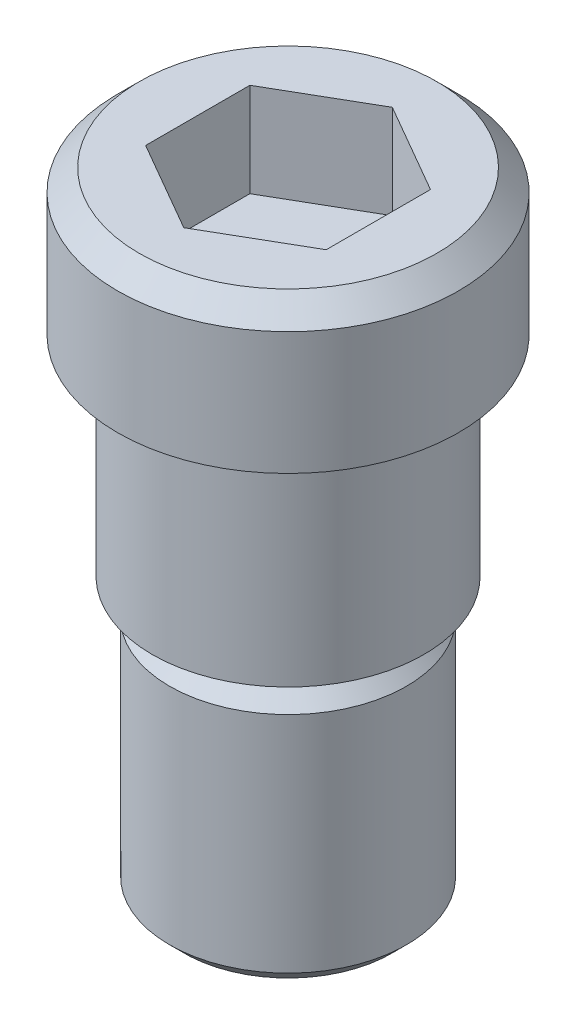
ISO-10303-21;
HEADER;
FILE_DESCRIPTION(('STEP AP214'),'2;1');
FILE_NAME('part.step','',(''),(''),'','','');
FILE_SCHEMA(('AUTOMOTIVE_DESIGN { 1 0 10303 214 1 1 1 1 }'));
ENDSEC;
DATA;
#1=APPLICATION_CONTEXT('core data for automotive mechanical design processes');
#2=APPLICATION_PROTOCOL_DEFINITION('international standard','automotive_design',2000,#1);
#3=PRODUCT_CONTEXT('',#1,'mechanical');
#4=PRODUCT('Part','Part','',(#3));
#5=PRODUCT_RELATED_PRODUCT_CATEGORY('part','',(#4));
#6=PRODUCT_DEFINITION_FORMATION('','',#4);
#7=PRODUCT_DEFINITION_CONTEXT('part definition',#1,'design');
#8=PRODUCT_DEFINITION('design','',#6,#7);
#9=PRODUCT_DEFINITION_SHAPE('','',#8);
#10=(LENGTH_UNIT() NAMED_UNIT(*) SI_UNIT(.MILLI.,.METRE.));
#11=(NAMED_UNIT(*) PLANE_ANGLE_UNIT() SI_UNIT($,.RADIAN.));
#12=(NAMED_UNIT(*) SI_UNIT($,.STERADIAN.) SOLID_ANGLE_UNIT());
#13=UNCERTAINTY_MEASURE_WITH_UNIT(LENGTH_MEASURE(1.E-05),#10,'distance_accuracy_value','');
#14=(GEOMETRIC_REPRESENTATION_CONTEXT(3) GLOBAL_UNCERTAINTY_ASSIGNED_CONTEXT((#13)) GLOBAL_UNIT_ASSIGNED_CONTEXT((#10,
#11,#12)) REPRESENTATION_CONTEXT('',''));
#15=CARTESIAN_POINT('',(0.,0.,0.));
#16=DIRECTION('',(0.,0.,1.));
#17=DIRECTION('',(1.,0.,0.));
#18=AXIS2_PLACEMENT_3D('',#15,#16,#17);
#19=CARTESIAN_POINT('',(-2.0828,-8.509,0.));
#20=DIRECTION('',(0.,-1.,0.));
#21=DIRECTION('',(0.,0.,-1.));
#22=AXIS2_PLACEMENT_3D('',#19,#20,#21);
#23=PLANE('',#22);
#24=CARTESIAN_POINT('',(0.,-8.509,0.));
#25=DIRECTION('',(0.,-1.,0.));
#26=DIRECTION('',(0.,0.,-1.));
#27=AXIS2_PLACEMENT_3D('',#24,#25,#26);
#28=CIRCLE('',#27,1.8288);
#29=CARTESIAN_POINT('',(0.,-8.509,-1.8288));
#30=VERTEX_POINT('',#29);
#31=EDGE_CURVE('E169',#30,#30,#28,.T.);
#32=ORIENTED_EDGE('',*,*,#31,.T.);
#33=EDGE_LOOP('',(#32));
#34=FACE_BOUND('',#33,.T.);
#35=ADVANCED_FACE('F32',(#34),#23,.T.);
#36=CARTESIAN_POINT('',(0.,7.87793789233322,0.));
#37=DIRECTION('',(0.,1.,0.));
#38=DIRECTION('',(0.,0.,1.));
#39=AXIS2_PLACEMENT_3D('',#36,#37,#38);
#40=CYLINDRICAL_SURFACE('',#39,2.0828);
#41=CARTESIAN_POINT('',(0.,-4.318,0.));
#42=DIRECTION('',(0.,1.,0.));
#43=DIRECTION('',(0.,0.,1.));
#44=AXIS2_PLACEMENT_3D('',#41,#42,#43);
#45=CIRCLE('',#44,2.0828);
#46=CARTESIAN_POINT('',(0.,-4.318,2.0828));
#47=VERTEX_POINT('',#46);
#48=EDGE_CURVE('E11',#47,#47,#45,.F.);
#49=ORIENTED_EDGE('',*,*,#48,.T.);
#50=EDGE_LOOP('',(#49));
#51=FACE_BOUND('',#50,.T.);
#52=CARTESIAN_POINT('',(0.,-8.255,0.));
#53=DIRECTION('',(0.,-1.,0.));
#54=DIRECTION('',(0.,0.,-1.));
#55=AXIS2_PLACEMENT_3D('',#52,#53,#54);
#56=CIRCLE('',#55,2.0828);
#57=CARTESIAN_POINT('',(0.,-8.255,-2.0828));
#58=VERTEX_POINT('',#57);
#59=EDGE_CURVE('E166',#58,#58,#56,.F.);
#60=ORIENTED_EDGE('',*,*,#59,.T.);
#61=EDGE_LOOP('',(#60));
#62=FACE_BOUND('',#61,.T.);
#63=ADVANCED_FACE('F186',(#51,#62),#40,.T.);
#64=CARTESIAN_POINT('',(-2.0828,-4.064,0.));
#65=DIRECTION('',(0.,1.,0.));
#66=DIRECTION('',(0.,0.,1.));
#67=AXIS2_PLACEMENT_3D('',#64,#65,#66);
#68=PLANE('',#67);
#69=CARTESIAN_POINT('',(0.,-4.064,0.));
#70=DIRECTION('',(0.,1.,0.));
#71=DIRECTION('',(0.,0.,1.));
#72=AXIS2_PLACEMENT_3D('',#69,#70,#71);
#73=CIRCLE('',#72,1.8288);
#74=CARTESIAN_POINT('',(0.,-4.064,1.8288));
#75=VERTEX_POINT('',#74);
#76=EDGE_CURVE('E40',#75,#75,#73,.T.);
#77=ORIENTED_EDGE('',*,*,#76,.T.);
#78=EDGE_LOOP('',(#77));
#79=FACE_BOUND('',#78,.T.);
#80=CARTESIAN_POINT('',(0.,-4.064,0.));
#81=DIRECTION('',(0.,1.,0.));
#82=DIRECTION('',(0.,0.,1.));
#83=AXIS2_PLACEMENT_3D('',#80,#81,#82);
#84=CIRCLE('',#83,1.685925);
#85=CARTESIAN_POINT('',(0.,-4.064,1.685925));
#86=VERTEX_POINT('',#85);
#87=EDGE_CURVE('E157',#86,#86,#84,.T.);
#88=ORIENTED_EDGE('',*,*,#87,.F.);
#89=EDGE_LOOP('',(#88));
#90=FACE_BOUND('',#89,.T.);
#91=ADVANCED_FACE('F174',(#79,#90),#68,.T.);
#92=CARTESIAN_POINT('',(0.,7.87793789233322,0.));
#93=DIRECTION('',(0.,1.,0.));
#94=DIRECTION('',(0.,0.,1.));
#95=AXIS2_PLACEMENT_3D('',#92,#93,#94);
#96=CYLINDRICAL_SURFACE('',#95,1.685925);
#97=ORIENTED_EDGE('',*,*,#87,.T.);
#98=EDGE_LOOP('',(#97));
#99=FACE_BOUND('',#98,.T.);
#100=CARTESIAN_POINT('',(0.,-3.683,0.));
#101=DIRECTION('',(0.,1.,0.));
#102=DIRECTION('',(0.,0.,1.));
#103=AXIS2_PLACEMENT_3D('',#100,#101,#102);
#104=CIRCLE('',#103,1.685925);
#105=CARTESIAN_POINT('',(0.,-3.683,1.685925));
#106=VERTEX_POINT('',#105);
#107=EDGE_CURVE('E154',#106,#106,#104,.T.);
#108=ORIENTED_EDGE('',*,*,#107,.F.);
#109=EDGE_LOOP('',(#108));
#110=FACE_BOUND('',#109,.T.);
#111=ADVANCED_FACE('F246',(#99,#110),#96,.T.);
#112=CARTESIAN_POINT('',(-2.3876,-3.683,0.));
#113=DIRECTION('',(0.,-1.,0.));
#114=DIRECTION('',(0.,0.,-1.));
#115=AXIS2_PLACEMENT_3D('',#112,#113,#114);
#116=PLANE('',#115);
#117=ORIENTED_EDGE('',*,*,#107,.T.);
#118=EDGE_LOOP('',(#117));
#119=FACE_BOUND('',#118,.T.);
#120=CARTESIAN_POINT('',(0.,-3.683,0.));
#121=DIRECTION('',(0.,1.,0.));
#122=DIRECTION('',(0.,0.,1.));
#123=AXIS2_PLACEMENT_3D('',#120,#121,#122);
#124=CIRCLE('',#123,2.3876);
#125=CARTESIAN_POINT('',(0.,-3.683,2.3876));
#126=VERTEX_POINT('',#125);
#127=EDGE_CURVE('E151',#126,#126,#124,.T.);
#128=ORIENTED_EDGE('',*,*,#127,.F.);
#129=EDGE_LOOP('',(#128));
#130=FACE_BOUND('',#129,.T.);
#131=ADVANCED_FACE('F242',(#119,#130),#116,.T.);
#132=CARTESIAN_POINT('',(0.,7.87793789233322,0.));
#133=DIRECTION('',(0.,1.,0.));
#134=DIRECTION('',(0.,0.,1.));
#135=AXIS2_PLACEMENT_3D('',#132,#133,#134);
#136=CYLINDRICAL_SURFACE('',#135,2.3876);
#137=ORIENTED_EDGE('',*,*,#127,.T.);
#138=EDGE_LOOP('',(#137));
#139=FACE_BOUND('',#138,.T.);
#140=CARTESIAN_POINT('',(0.,-0.380999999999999,0.));
#141=DIRECTION('',(0.,1.,0.));
#142=DIRECTION('',(0.,0.,1.));
#143=AXIS2_PLACEMENT_3D('',#140,#141,#142);
#144=CIRCLE('',#143,2.3876);
#145=CARTESIAN_POINT('',(0.,-0.380999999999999,2.3876));
#146=VERTEX_POINT('',#145);
#147=EDGE_CURVE('E148',#146,#146,#144,.T.);
#148=ORIENTED_EDGE('',*,*,#147,.F.);
#149=EDGE_LOOP('',(#148));
#150=FACE_BOUND('',#149,.T.);
#151=ADVANCED_FACE('F238',(#139,#150),#136,.T.);
#152=CARTESIAN_POINT('',(-2.3876,-0.381,0.));
#153=DIRECTION('',(0.,1.,0.));
#154=DIRECTION('',(0.,0.,1.));
#155=AXIS2_PLACEMENT_3D('',#152,#153,#154);
#156=PLANE('',#155);
#157=ORIENTED_EDGE('',*,*,#147,.T.);
#158=EDGE_LOOP('',(#157));
#159=FACE_BOUND('',#158,.T.);
#160=CARTESIAN_POINT('',(0.,-0.380999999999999,0.));
#161=DIRECTION('',(0.,1.,0.));
#162=DIRECTION('',(0.,0.,1.));
#163=AXIS2_PLACEMENT_3D('',#160,#161,#162);
#164=CIRCLE('',#163,1.990725);
#165=CARTESIAN_POINT('',(0.,-0.380999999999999,1.990725));
#166=VERTEX_POINT('',#165);
#167=EDGE_CURVE('E145',#166,#166,#164,.T.);
#168=ORIENTED_EDGE('',*,*,#167,.F.);
#169=EDGE_LOOP('',(#168));
#170=FACE_BOUND('',#169,.T.);
#171=ADVANCED_FACE('F234',(#159,#170),#156,.T.);
#172=CARTESIAN_POINT('',(0.,7.87793789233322,0.));
#173=DIRECTION('',(0.,1.,0.));
#174=DIRECTION('',(0.,0.,1.));
#175=AXIS2_PLACEMENT_3D('',#172,#173,#174);
#176=CYLINDRICAL_SURFACE('',#175,1.990725);
#177=ORIENTED_EDGE('',*,*,#167,.T.);
#178=EDGE_LOOP('',(#177));
#179=FACE_BOUND('',#178,.T.);
#180=CARTESIAN_POINT('',(0.,0.,0.));
#181=DIRECTION('',(0.,1.,0.));
#182=DIRECTION('',(0.,0.,1.));
#183=AXIS2_PLACEMENT_3D('',#180,#181,#182);
#184=CIRCLE('',#183,1.990725);
#185=CARTESIAN_POINT('',(0.,0.,1.990725));
#186=VERTEX_POINT('',#185);
#187=EDGE_CURVE('E142',#186,#186,#184,.T.);
#188=ORIENTED_EDGE('',*,*,#187,.F.);
#189=EDGE_LOOP('',(#188));
#190=FACE_BOUND('',#189,.T.);
#191=ADVANCED_FACE('F230',(#179,#190),#176,.T.);
#192=CARTESIAN_POINT('',(-2.9972,0.,0.));
#193=DIRECTION('',(0.,-1.,0.));
#194=DIRECTION('',(0.,0.,-1.));
#195=AXIS2_PLACEMENT_3D('',#192,#193,#194);
#196=PLANE('',#195);
#197=ORIENTED_EDGE('',*,*,#187,.T.);
#198=EDGE_LOOP('',(#197));
#199=FACE_BOUND('',#198,.T.);
#200=CARTESIAN_POINT('',(0.,0.,0.));
#201=DIRECTION('',(0.,1.,0.));
#202=DIRECTION('',(0.,0.,1.));
#203=AXIS2_PLACEMENT_3D('',#200,#201,#202);
#204=CIRCLE('',#203,2.9972);
#205=CARTESIAN_POINT('',(0.,0.,2.9972));
#206=VERTEX_POINT('',#205);
#207=EDGE_CURVE('E134',#206,#206,#204,.T.);
#208=ORIENTED_EDGE('',*,*,#207,.F.);
#209=EDGE_LOOP('',(#208));
#210=FACE_BOUND('',#209,.T.);
#211=ADVANCED_FACE('F226',(#199,#210),#196,.T.);
#212=CARTESIAN_POINT('',(0.,7.87793789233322,0.));
#213=DIRECTION('',(0.,1.,0.));
#214=DIRECTION('',(0.,0.,1.));
#215=AXIS2_PLACEMENT_3D('',#212,#213,#214);
#216=CYLINDRICAL_SURFACE('',#215,2.9972);
#217=CARTESIAN_POINT('',(0.,2.159,0.));
#218=DIRECTION('',(0.,1.,0.));
#219=DIRECTION('',(0.,0.,1.));
#220=AXIS2_PLACEMENT_3D('',#217,#218,#219);
#221=CIRCLE('',#220,2.9972);
#222=CARTESIAN_POINT('',(0.,2.159,2.9972));
#223=VERTEX_POINT('',#222);
#224=EDGE_CURVE('E163',#223,#223,#221,.F.);
#225=ORIENTED_EDGE('',*,*,#224,.T.);
#226=EDGE_LOOP('',(#225));
#227=FACE_BOUND('',#226,.T.);
#228=ORIENTED_EDGE('',*,*,#207,.T.);
#229=EDGE_LOOP('',(#228));
#230=FACE_BOUND('',#229,.T.);
#231=ADVANCED_FACE('F222',(#227,#230),#216,.T.);
#232=CARTESIAN_POINT('',(0.,2.54,0.));
#233=DIRECTION('',(0.,1.,0.));
#234=DIRECTION('',(0.,0.,1.));
#235=AXIS2_PLACEMENT_3D('',#232,#233,#234);
#236=PLANE('',#235);
#237=DIRECTION('',(-0.866025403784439,0.,0.499999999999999));
#238=VECTOR('',#237,1.);
#239=CARTESIAN_POINT('',(-1.5875,2.54,-0.916543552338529));
#240=LINE('',#239,#238);
#241=CARTESIAN_POINT('',(0.,2.54,-1.83308710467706));
#242=VERTEX_POINT('',#241);
#243=CARTESIAN_POINT('',(-1.5875,2.54,-0.916543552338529));
#244=VERTEX_POINT('',#243);
#245=EDGE_CURVE('E47',#242,#244,#240,.T.);
#246=ORIENTED_EDGE('',*,*,#245,.F.);
#247=DIRECTION('',(-0.866025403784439,0.,-0.499999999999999));
#248=VECTOR('',#247,1.);
#249=CARTESIAN_POINT('',(0.,2.54,-1.83308710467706));
#250=LINE('',#249,#248);
#251=CARTESIAN_POINT('',(1.5875,2.54,-0.916543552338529));
#252=VERTEX_POINT('',#251);
#253=EDGE_CURVE('E130',#252,#242,#250,.T.);
#254=ORIENTED_EDGE('',*,*,#253,.F.);
#255=DIRECTION('',(0.,0.,-1.));
#256=VECTOR('',#255,1.);
#257=CARTESIAN_POINT('',(1.5875,2.54,-0.916543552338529));
#258=LINE('',#257,#256);
#259=CARTESIAN_POINT('',(1.5875,2.54,0.916543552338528));
#260=VERTEX_POINT('',#259);
#261=EDGE_CURVE('E128',#260,#252,#258,.T.);
#262=ORIENTED_EDGE('',*,*,#261,.F.);
#263=DIRECTION('',(0.866025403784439,0.,-0.499999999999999));
#264=VECTOR('',#263,1.);
#265=CARTESIAN_POINT('',(0.,2.54,1.83308710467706));
#266=LINE('',#265,#264);
#267=CARTESIAN_POINT('',(0.,2.54,1.83308710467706));
#268=VERTEX_POINT('',#267);
#269=EDGE_CURVE('E95',#268,#260,#266,.T.);
#270=ORIENTED_EDGE('',*,*,#269,.F.);
#271=DIRECTION('',(0.86602540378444,0.,0.499999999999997));
#272=VECTOR('',#271,1.);
#273=CARTESIAN_POINT('',(-1.5875,2.54,0.916543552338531));
#274=LINE('',#273,#272);
#275=CARTESIAN_POINT('',(-1.5875,2.54,0.916543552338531));
#276=VERTEX_POINT('',#275);
#277=EDGE_CURVE('E124',#276,#268,#274,.T.);
#278=ORIENTED_EDGE('',*,*,#277,.F.);
#279=DIRECTION('',(0.,0.,1.));
#280=VECTOR('',#279,1.);
#281=CARTESIAN_POINT('',(-1.5875,2.54,0.916543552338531));
#282=LINE('',#281,#280);
#283=EDGE_CURVE('E121',#244,#276,#282,.T.);
#284=ORIENTED_EDGE('',*,*,#283,.F.);
#285=EDGE_LOOP('',(#246,#254,#262,#270,#278,#284));
#286=FACE_BOUND('',#285,.T.);
#287=CARTESIAN_POINT('',(0.,2.54,0.));
#288=DIRECTION('',(0.,1.,0.));
#289=DIRECTION('',(0.,0.,1.));
#290=AXIS2_PLACEMENT_3D('',#287,#288,#289);
#291=CIRCLE('',#290,2.6162);
#292=CARTESIAN_POINT('',(0.,2.54,2.6162));
#293=VERTEX_POINT('',#292);
#294=EDGE_CURVE('E160',#293,#293,#291,.T.);
#295=ORIENTED_EDGE('',*,*,#294,.T.);
#296=EDGE_LOOP('',(#295));
#297=FACE_BOUND('',#296,.T.);
#298=ADVANCED_FACE('F199',(#286,#297),#236,.T.);
#299=CARTESIAN_POINT('',(0.,2.54,0.));
#300=DIRECTION('',(0.,-1.,0.));
#301=DIRECTION('',(0.,0.,-1.));
#302=AXIS2_PLACEMENT_3D('',#299,#300,#301);
#303=CONICAL_SURFACE('',#302,2.6162,0.785398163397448);
#304=ORIENTED_EDGE('',*,*,#224,.F.);
#305=EDGE_LOOP('',(#304));
#306=FACE_BOUND('',#305,.T.);
#307=ORIENTED_EDGE('',*,*,#294,.F.);
#308=EDGE_LOOP('',(#307));
#309=FACE_BOUND('',#308,.T.);
#310=ADVANCED_FACE('F196',(#306,#309),#303,.T.);
#311=CARTESIAN_POINT('',(0.,-8.255,0.));
#312=DIRECTION('',(0.,1.,0.));
#313=DIRECTION('',(0.,0.,1.));
#314=AXIS2_PLACEMENT_3D('',#311,#312,#313);
#315=CONICAL_SURFACE('',#314,2.0828,0.78539816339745);
#316=ORIENTED_EDGE('',*,*,#31,.F.);
#317=EDGE_LOOP('',(#316));
#318=FACE_BOUND('',#317,.T.);
#319=ORIENTED_EDGE('',*,*,#59,.F.);
#320=EDGE_LOOP('',(#319));
#321=FACE_BOUND('',#320,.T.);
#322=ADVANCED_FACE('F198',(#318,#321),#315,.T.);
#323=CARTESIAN_POINT('',(-1.5875,0.889000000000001,-0.916543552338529));
#324=DIRECTION('',(-0.499999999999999,0.,-0.866025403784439));
#325=DIRECTION('',(-0.86602540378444,0.,0.499999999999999));
#326=AXIS2_PLACEMENT_3D('',#323,#324,#325);
#327=PLANE('',#326);
#328=ORIENTED_EDGE('',*,*,#245,.T.);
#329=DIRECTION('',(0.,1.,0.));
#330=VECTOR('',#329,1.);
#331=CARTESIAN_POINT('',(-1.5875,0.889000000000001,-0.916543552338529));
#332=LINE('',#331,#330);
#333=CARTESIAN_POINT('',(-1.5875,0.889000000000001,-0.916543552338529));
#334=VERTEX_POINT('',#333);
#335=EDGE_CURVE('E77',#334,#244,#332,.T.);
#336=ORIENTED_EDGE('',*,*,#335,.F.);
#337=DIRECTION('',(-0.866025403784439,0.,0.499999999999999));
#338=VECTOR('',#337,1.);
#339=CARTESIAN_POINT('',(-1.5875,0.889000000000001,-0.916543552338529));
#340=LINE('',#339,#338);
#341=CARTESIAN_POINT('',(0.,0.889000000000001,-1.83308710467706));
#342=VERTEX_POINT('',#341);
#343=EDGE_CURVE('E132',#342,#334,#340,.T.);
#344=ORIENTED_EDGE('',*,*,#343,.F.);
#345=DIRECTION('',(0.,1.,0.));
#346=VECTOR('',#345,1.);
#347=CARTESIAN_POINT('',(0.,0.889000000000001,-1.83308710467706));
#348=LINE('',#347,#346);
#349=EDGE_CURVE('E55',#342,#242,#348,.T.);
#350=ORIENTED_EDGE('',*,*,#349,.T.);
#351=EDGE_LOOP('',(#328,#336,#344,#350));
#352=FACE_BOUND('',#351,.T.);
#353=ADVANCED_FACE('F202',(#352),#327,.F.);
#354=CARTESIAN_POINT('',(0.,0.889000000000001,-1.83308710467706));
#355=DIRECTION('',(0.499999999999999,0.,-0.866025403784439));
#356=DIRECTION('',(-0.86602540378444,0.,-0.499999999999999));
#357=AXIS2_PLACEMENT_3D('',#354,#355,#356);
#358=PLANE('',#357);
#359=ORIENTED_EDGE('',*,*,#253,.T.);
#360=ORIENTED_EDGE('',*,*,#349,.F.);
#361=DIRECTION('',(-0.866025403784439,0.,-0.499999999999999));
#362=VECTOR('',#361,1.);
#363=CARTESIAN_POINT('',(0.,0.889000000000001,-1.83308710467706));
#364=LINE('',#363,#362);
#365=CARTESIAN_POINT('',(1.5875,0.889000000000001,-0.916543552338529));
#366=VERTEX_POINT('',#365);
#367=EDGE_CURVE('E107',#366,#342,#364,.T.);
#368=ORIENTED_EDGE('',*,*,#367,.F.);
#369=DIRECTION('',(0.,1.,0.));
#370=VECTOR('',#369,1.);
#371=CARTESIAN_POINT('',(1.5875,0.889000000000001,-0.916543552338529));
#372=LINE('',#371,#370);
#373=EDGE_CURVE('E99',#366,#252,#372,.T.);
#374=ORIENTED_EDGE('',*,*,#373,.T.);
#375=EDGE_LOOP('',(#359,#360,#368,#374));
#376=FACE_BOUND('',#375,.T.);
#377=ADVANCED_FACE('F207',(#376),#358,.F.);
#378=CARTESIAN_POINT('',(1.5875,0.889000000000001,-0.916543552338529));
#379=DIRECTION('',(1.,0.,0.));
#380=DIRECTION('',(0.,0.,-1.));
#381=AXIS2_PLACEMENT_3D('',#378,#379,#380);
#382=PLANE('',#381);
#383=ORIENTED_EDGE('',*,*,#261,.T.);
#384=ORIENTED_EDGE('',*,*,#373,.F.);
#385=DIRECTION('',(0.,0.,-1.));
#386=VECTOR('',#385,1.);
#387=CARTESIAN_POINT('',(1.5875,0.889000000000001,-0.916543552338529));
#388=LINE('',#387,#386);
#389=CARTESIAN_POINT('',(1.5875,0.889000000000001,0.916543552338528));
#390=VERTEX_POINT('',#389);
#391=EDGE_CURVE('E103',#390,#366,#388,.T.);
#392=ORIENTED_EDGE('',*,*,#391,.F.);
#393=DIRECTION('',(0.,1.,0.));
#394=VECTOR('',#393,1.);
#395=CARTESIAN_POINT('',(1.5875,0.889000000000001,0.916543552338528));
#396=LINE('',#395,#394);
#397=EDGE_CURVE('E88',#390,#260,#396,.T.);
#398=ORIENTED_EDGE('',*,*,#397,.T.);
#399=EDGE_LOOP('',(#383,#384,#392,#398));
#400=FACE_BOUND('',#399,.T.);
#401=ADVANCED_FACE('F104',(#400),#382,.F.);
#402=CARTESIAN_POINT('',(0.,0.889000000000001,1.83308710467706));
#403=DIRECTION('',(0.499999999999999,0.,0.866025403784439));
#404=DIRECTION('',(0.866025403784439,0.,-0.499999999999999));
#405=AXIS2_PLACEMENT_3D('',#402,#403,#404);
#406=PLANE('',#405);
#407=ORIENTED_EDGE('',*,*,#269,.T.);
#408=ORIENTED_EDGE('',*,*,#397,.F.);
#409=DIRECTION('',(0.866025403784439,0.,-0.499999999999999));
#410=VECTOR('',#409,1.);
#411=CARTESIAN_POINT('',(0.,0.889000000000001,1.83308710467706));
#412=LINE('',#411,#410);
#413=CARTESIAN_POINT('',(0.,0.889000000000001,1.83308710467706));
#414=VERTEX_POINT('',#413);
#415=EDGE_CURVE('E92',#414,#390,#412,.T.);
#416=ORIENTED_EDGE('',*,*,#415,.F.);
#417=DIRECTION('',(0.,1.,0.));
#418=VECTOR('',#417,1.);
#419=CARTESIAN_POINT('',(0.,0.889000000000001,1.83308710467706));
#420=LINE('',#419,#418);
#421=EDGE_CURVE('E100',#414,#268,#420,.T.);
#422=ORIENTED_EDGE('',*,*,#421,.T.);
#423=EDGE_LOOP('',(#407,#408,#416,#422));
#424=FACE_BOUND('',#423,.T.);
#425=ADVANCED_FACE('F90',(#424),#406,.F.);
#426=CARTESIAN_POINT('',(-1.5875,0.889000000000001,0.916543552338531));
#427=DIRECTION('',(-0.499999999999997,0.,0.86602540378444));
#428=DIRECTION('',(0.86602540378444,0.,0.499999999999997));
#429=AXIS2_PLACEMENT_3D('',#426,#427,#428);
#430=PLANE('',#429);
#431=ORIENTED_EDGE('',*,*,#277,.T.);
#432=ORIENTED_EDGE('',*,*,#421,.F.);
#433=DIRECTION('',(0.86602540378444,0.,0.499999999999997));
#434=VECTOR('',#433,1.);
#435=CARTESIAN_POINT('',(-1.5875,0.889000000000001,0.916543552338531));
#436=LINE('',#435,#434);
#437=CARTESIAN_POINT('',(-1.5875,0.889000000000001,0.916543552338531));
#438=VERTEX_POINT('',#437);
#439=EDGE_CURVE('E113',#438,#414,#436,.T.);
#440=ORIENTED_EDGE('',*,*,#439,.F.);
#441=DIRECTION('',(0.,1.,0.));
#442=VECTOR('',#441,1.);
#443=CARTESIAN_POINT('',(-1.5875,0.889000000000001,0.916543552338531));
#444=LINE('',#443,#442);
#445=EDGE_CURVE('E137',#438,#276,#444,.T.);
#446=ORIENTED_EDGE('',*,*,#445,.T.);
#447=EDGE_LOOP('',(#431,#432,#440,#446));
#448=FACE_BOUND('',#447,.T.);
#449=ADVANCED_FACE('F326',(#448),#430,.F.);
#450=CARTESIAN_POINT('',(-1.5875,0.889000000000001,0.916543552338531));
#451=DIRECTION('',(-1.,0.,0.));
#452=DIRECTION('',(0.,0.,1.));
#453=AXIS2_PLACEMENT_3D('',#450,#451,#452);
#454=PLANE('',#453);
#455=ORIENTED_EDGE('',*,*,#283,.T.);
#456=ORIENTED_EDGE('',*,*,#445,.F.);
#457=DIRECTION('',(0.,0.,1.));
#458=VECTOR('',#457,1.);
#459=CARTESIAN_POINT('',(-1.5875,0.889000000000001,0.916543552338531));
#460=LINE('',#459,#458);
#461=EDGE_CURVE('E115',#334,#438,#460,.T.);
#462=ORIENTED_EDGE('',*,*,#461,.F.);
#463=ORIENTED_EDGE('',*,*,#335,.T.);
#464=EDGE_LOOP('',(#455,#456,#462,#463));
#465=FACE_BOUND('',#464,.T.);
#466=ADVANCED_FACE('F182',(#465),#454,.F.);
#467=CARTESIAN_POINT('',(1.5875,0.889000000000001,-2.74963065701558));
#468=DIRECTION('',(0.,-1.,0.));
#469=DIRECTION('',(0.,0.,-1.));
#470=AXIS2_PLACEMENT_3D('',#467,#468,#469);
#471=PLANE('',#470);
#472=ORIENTED_EDGE('',*,*,#343,.T.);
#473=ORIENTED_EDGE('',*,*,#461,.T.);
#474=ORIENTED_EDGE('',*,*,#439,.T.);
#475=ORIENTED_EDGE('',*,*,#415,.T.);
#476=ORIENTED_EDGE('',*,*,#391,.T.);
#477=ORIENTED_EDGE('',*,*,#367,.T.);
#478=EDGE_LOOP('',(#472,#473,#474,#475,#476,#477));
#479=FACE_BOUND('',#478,.T.);
#480=ADVANCED_FACE('F110',(#479),#471,.F.);
#481=CARTESIAN_POINT('',(0.,-4.064,0.));
#482=DIRECTION('',(0.,-1.,0.));
#483=DIRECTION('',(0.,0.,-1.));
#484=AXIS2_PLACEMENT_3D('',#481,#482,#483);
#485=CONICAL_SURFACE('',#484,1.8288,0.785398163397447);
#486=ORIENTED_EDGE('',*,*,#48,.F.);
#487=EDGE_LOOP('',(#486));
#488=FACE_BOUND('',#487,.T.);
#489=ORIENTED_EDGE('',*,*,#76,.F.);
#490=EDGE_LOOP('',(#489));
#491=FACE_BOUND('',#490,.T.);
#492=ADVANCED_FACE('F34',(#488,#491),#485,.T.);
#493=CLOSED_SHELL('',(#35,#63,#91,#111,#131,#151,#171,#191,#211,#231,#298,#310,#322,#353,#377,
#401,#425,#449,#466,#480,#492));
#494=MANIFOLD_SOLID_BREP('B2',#493);
#495=ADVANCED_BREP_SHAPE_REPRESENTATION('',(#18,#494),#14);
#496=SHAPE_DEFINITION_REPRESENTATION(#9,#495);
ENDSEC;
END-ISO-10303-21;
